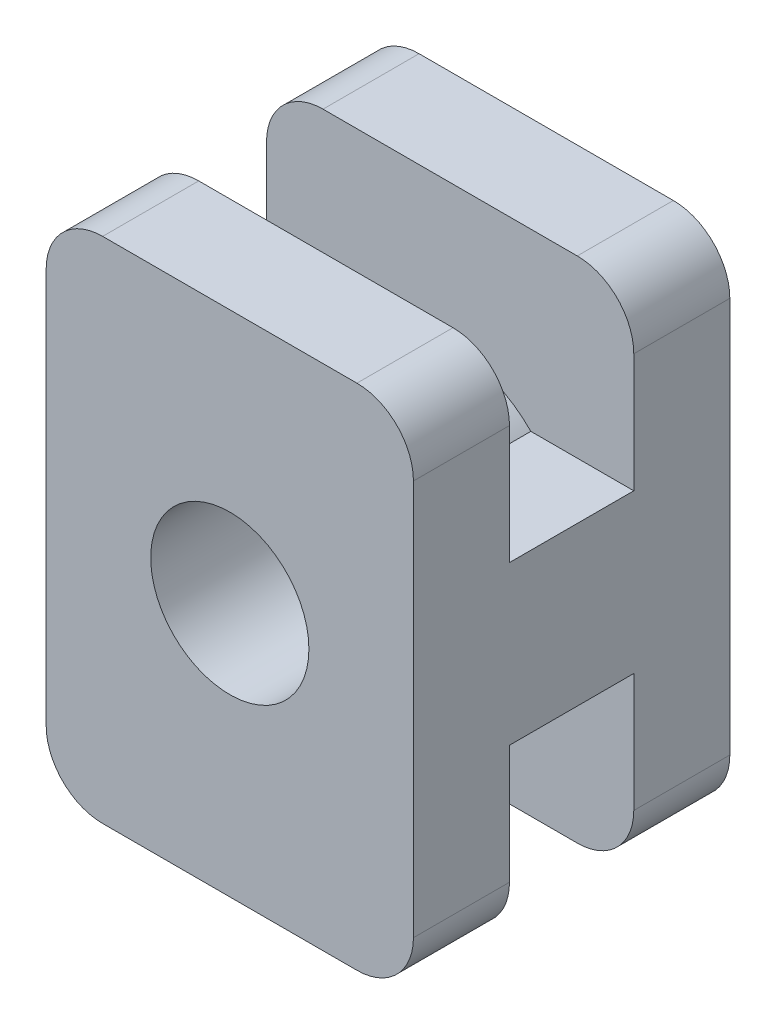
ISO-10303-21;
HEADER;
FILE_DESCRIPTION(('STEP AP214'),'2;1');
FILE_NAME('part.step','',(''),(''),'','','');
FILE_SCHEMA(('AUTOMOTIVE_DESIGN { 1 0 10303 214 1 1 1 1 }'));
ENDSEC;
DATA;
#1=APPLICATION_CONTEXT('core data for automotive mechanical design processes');
#2=APPLICATION_PROTOCOL_DEFINITION('international standard','automotive_design',2000,#1);
#3=PRODUCT_CONTEXT('',#1,'mechanical');
#4=PRODUCT('Part','Part','',(#3));
#5=PRODUCT_RELATED_PRODUCT_CATEGORY('part','',(#4));
#6=PRODUCT_DEFINITION_FORMATION('','',#4);
#7=PRODUCT_DEFINITION_CONTEXT('part definition',#1,'design');
#8=PRODUCT_DEFINITION('design','',#6,#7);
#9=PRODUCT_DEFINITION_SHAPE('','',#8);
#10=(LENGTH_UNIT() NAMED_UNIT(*) SI_UNIT(.MILLI.,.METRE.));
#11=(NAMED_UNIT(*) PLANE_ANGLE_UNIT() SI_UNIT($,.RADIAN.));
#12=(NAMED_UNIT(*) SI_UNIT($,.STERADIAN.) SOLID_ANGLE_UNIT());
#13=UNCERTAINTY_MEASURE_WITH_UNIT(LENGTH_MEASURE(1.E-05),#10,'distance_accuracy_value','');
#14=(GEOMETRIC_REPRESENTATION_CONTEXT(3) GLOBAL_UNCERTAINTY_ASSIGNED_CONTEXT((#13)) GLOBAL_UNIT_ASSIGNED_CONTEXT((#10,
#11,#12)) REPRESENTATION_CONTEXT('',''));
#15=CARTESIAN_POINT('',(0.,0.,0.));
#16=DIRECTION('',(0.,0.,1.));
#17=DIRECTION('',(1.,0.,0.));
#18=AXIS2_PLACEMENT_3D('',#15,#16,#17);
#19=CARTESIAN_POINT('',(-2.25,-3.5,2.8));
#20=DIRECTION('',(0.,0.,-1.));
#21=DIRECTION('',(-1.,0.,0.));
#22=AXIS2_PLACEMENT_3D('',#19,#20,#21);
#23=CYLINDRICAL_SURFACE('',#22,1.);
#24=CARTESIAN_POINT('',(-2.25,-3.5,1.1));
#25=DIRECTION('',(0.,0.,-1.));
#26=DIRECTION('',(-1.,0.,0.));
#27=AXIS2_PLACEMENT_3D('',#24,#25,#26);
#28=CIRCLE('',#27,1.);
#29=CARTESIAN_POINT('',(-2.25,-4.5,1.1));
#30=VERTEX_POINT('',#29);
#31=CARTESIAN_POINT('',(-3.25,-3.5,1.1));
#32=VERTEX_POINT('',#31);
#33=EDGE_CURVE('E20',#30,#32,#28,.T.);
#34=ORIENTED_EDGE('',*,*,#33,.F.);
#35=DIRECTION('',(0.,0.,1.));
#36=VECTOR('',#35,1.);
#37=CARTESIAN_POINT('',(-2.25,-4.5,2.8));
#38=LINE('',#37,#36);
#39=CARTESIAN_POINT('',(-2.25,-4.5,2.8));
#40=VERTEX_POINT('',#39);
#41=EDGE_CURVE('E144',#30,#40,#38,.T.);
#42=ORIENTED_EDGE('',*,*,#41,.T.);
#43=CARTESIAN_POINT('',(-2.25,-3.5,2.8));
#44=DIRECTION('',(0.,0.,-1.));
#45=DIRECTION('',(-1.,0.,0.));
#46=AXIS2_PLACEMENT_3D('',#43,#44,#45);
#47=CIRCLE('',#46,1.);
#48=CARTESIAN_POINT('',(-3.25,-3.5,2.8));
#49=VERTEX_POINT('',#48);
#50=EDGE_CURVE('E159',#40,#49,#47,.T.);
#51=ORIENTED_EDGE('',*,*,#50,.T.);
#52=DIRECTION('',(0.,0.,-1.));
#53=VECTOR('',#52,1.);
#54=CARTESIAN_POINT('',(-3.25,-3.5,2.8));
#55=LINE('',#54,#53);
#56=EDGE_CURVE('E158',#49,#32,#55,.T.);
#57=ORIENTED_EDGE('',*,*,#56,.T.);
#58=EDGE_LOOP('',(#34,#42,#51,#57));
#59=FACE_BOUND('',#58,.T.);
#60=ADVANCED_FACE('F17',(#59),#23,.T.);
#61=CARTESIAN_POINT('',(-3.25,-4.5,2.8));
#62=DIRECTION('',(1.,0.,0.));
#63=DIRECTION('',(0.,0.,-1.));
#64=AXIS2_PLACEMENT_3D('',#61,#62,#63);
#65=PLANE('',#64);
#66=DIRECTION('',(0.,0.,-1.));
#67=VECTOR('',#66,1.);
#68=CARTESIAN_POINT('',(-3.25,3.5,2.8));
#69=LINE('',#68,#67);
#70=CARTESIAN_POINT('',(-3.25,3.5,1.1));
#71=VERTEX_POINT('',#70);
#72=CARTESIAN_POINT('',(-3.25,3.5,2.8));
#73=VERTEX_POINT('',#72);
#74=EDGE_CURVE('E163',#71,#73,#69,.F.);
#75=ORIENTED_EDGE('',*,*,#74,.F.);
#76=DIRECTION('',(0.,1.,0.));
#77=VECTOR('',#76,1.);
#78=CARTESIAN_POINT('',(-3.25,0.,1.1));
#79=LINE('',#78,#77);
#80=EDGE_CURVE('E152',#32,#71,#79,.T.);
#81=ORIENTED_EDGE('',*,*,#80,.F.);
#82=ORIENTED_EDGE('',*,*,#56,.F.);
#83=DIRECTION('',(0.,1.,0.));
#84=VECTOR('',#83,1.);
#85=CARTESIAN_POINT('',(-3.25,0.,2.8));
#86=LINE('',#85,#84);
#87=EDGE_CURVE('E269',#49,#73,#86,.T.);
#88=ORIENTED_EDGE('',*,*,#87,.T.);
#89=EDGE_LOOP('',(#75,#81,#82,#88));
#90=FACE_BOUND('',#89,.T.);
#91=ADVANCED_FACE('F165',(#90),#65,.F.);
#92=CARTESIAN_POINT('',(-2.25,3.5,2.8));
#93=DIRECTION('',(0.,0.,-1.));
#94=DIRECTION('',(-1.,0.,0.));
#95=AXIS2_PLACEMENT_3D('',#92,#93,#94);
#96=CYLINDRICAL_SURFACE('',#95,1.);
#97=CARTESIAN_POINT('',(-2.25,3.5,1.1));
#98=DIRECTION('',(0.,0.,-1.));
#99=DIRECTION('',(-1.,0.,0.));
#100=AXIS2_PLACEMENT_3D('',#97,#98,#99);
#101=CIRCLE('',#100,1.);
#102=CARTESIAN_POINT('',(-2.25,4.5,1.1));
#103=VERTEX_POINT('',#102);
#104=EDGE_CURVE('E167',#71,#103,#101,.T.);
#105=ORIENTED_EDGE('',*,*,#104,.F.);
#106=ORIENTED_EDGE('',*,*,#74,.T.);
#107=CARTESIAN_POINT('',(-2.25,3.5,2.8));
#108=DIRECTION('',(0.,0.,-1.));
#109=DIRECTION('',(-1.,0.,0.));
#110=AXIS2_PLACEMENT_3D('',#107,#108,#109);
#111=CIRCLE('',#110,1.);
#112=CARTESIAN_POINT('',(-2.25,4.5,2.8));
#113=VERTEX_POINT('',#112);
#114=EDGE_CURVE('E266',#73,#113,#111,.T.);
#115=ORIENTED_EDGE('',*,*,#114,.T.);
#116=DIRECTION('',(0.,0.,-1.));
#117=VECTOR('',#116,1.);
#118=CARTESIAN_POINT('',(-2.25,4.5,2.8));
#119=LINE('',#118,#117);
#120=EDGE_CURVE('E214',#113,#103,#119,.T.);
#121=ORIENTED_EDGE('',*,*,#120,.T.);
#122=EDGE_LOOP('',(#105,#106,#115,#121));
#123=FACE_BOUND('',#122,.T.);
#124=ADVANCED_FACE('F352',(#123),#96,.T.);
#125=CARTESIAN_POINT('',(-3.25,4.5,2.8));
#126=DIRECTION('',(0.,-1.,0.));
#127=DIRECTION('',(0.,0.,-1.));
#128=AXIS2_PLACEMENT_3D('',#125,#126,#127);
#129=PLANE('',#128);
#130=ORIENTED_EDGE('',*,*,#120,.F.);
#131=DIRECTION('',(-1.,0.,0.));
#132=VECTOR('',#131,1.);
#133=CARTESIAN_POINT('',(0.,4.5,2.8));
#134=LINE('',#133,#132);
#135=CARTESIAN_POINT('',(2.25,4.5,2.8));
#136=VERTEX_POINT('',#135);
#137=EDGE_CURVE('E265',#113,#136,#134,.F.);
#138=ORIENTED_EDGE('',*,*,#137,.T.);
#139=DIRECTION('',(0.,0.,-1.));
#140=VECTOR('',#139,1.);
#141=CARTESIAN_POINT('',(2.25,4.5,2.8));
#142=LINE('',#141,#140);
#143=CARTESIAN_POINT('',(2.25,4.5,1.1));
#144=VERTEX_POINT('',#143);
#145=EDGE_CURVE('E210',#144,#136,#142,.F.);
#146=ORIENTED_EDGE('',*,*,#145,.F.);
#147=DIRECTION('',(-1.,0.,0.));
#148=VECTOR('',#147,1.);
#149=CARTESIAN_POINT('',(0.,4.5,1.1));
#150=LINE('',#149,#148);
#151=EDGE_CURVE('E169',#103,#144,#150,.F.);
#152=ORIENTED_EDGE('',*,*,#151,.F.);
#153=EDGE_LOOP('',(#130,#138,#146,#152));
#154=FACE_BOUND('',#153,.T.);
#155=ADVANCED_FACE('F284',(#154),#129,.F.);
#156=CARTESIAN_POINT('',(-3.25,-4.5,2.8));
#157=DIRECTION('',(0.,1.,0.));
#158=DIRECTION('',(0.,0.,1.));
#159=AXIS2_PLACEMENT_3D('',#156,#157,#158);
#160=PLANE('',#159);
#161=DIRECTION('',(0.,0.,-1.));
#162=VECTOR('',#161,1.);
#163=CARTESIAN_POINT('',(2.25,-4.5,1.1));
#164=LINE('',#163,#162);
#165=CARTESIAN_POINT('',(2.25,-4.5,2.8));
#166=VERTEX_POINT('',#165);
#167=CARTESIAN_POINT('',(2.25,-4.5,1.1));
#168=VERTEX_POINT('',#167);
#169=EDGE_CURVE('E215',#166,#168,#164,.T.);
#170=ORIENTED_EDGE('',*,*,#169,.F.);
#171=DIRECTION('',(-1.,0.,0.));
#172=VECTOR('',#171,1.);
#173=CARTESIAN_POINT('',(0.,-4.5,2.8));
#174=LINE('',#173,#172);
#175=EDGE_CURVE('E261',#166,#40,#174,.T.);
#176=ORIENTED_EDGE('',*,*,#175,.T.);
#177=ORIENTED_EDGE('',*,*,#41,.F.);
#178=DIRECTION('',(-1.,0.,0.));
#179=VECTOR('',#178,1.);
#180=CARTESIAN_POINT('',(0.,-4.5,1.1));
#181=LINE('',#180,#179);
#182=EDGE_CURVE('E155',#168,#30,#181,.T.);
#183=ORIENTED_EDGE('',*,*,#182,.F.);
#184=EDGE_LOOP('',(#170,#176,#177,#183));
#185=FACE_BOUND('',#184,.T.);
#186=ADVANCED_FACE('F341',(#185),#160,.F.);
#187=CARTESIAN_POINT('',(0.,0.,1.1));
#188=DIRECTION('',(0.,0.,-1.));
#189=DIRECTION('',(-1.,0.,0.));
#190=AXIS2_PLACEMENT_3D('',#187,#188,#189);
#191=CYLINDRICAL_SURFACE('',#190,2.);
#192=DIRECTION('',(0.,0.,-1.));
#193=VECTOR('',#192,1.);
#194=CARTESIAN_POINT('',(1.42828568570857,1.4,1.1));
#195=LINE('',#194,#193);
#196=CARTESIAN_POINT('',(1.42828568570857,1.4,1.1));
#197=VERTEX_POINT('',#196);
#198=CARTESIAN_POINT('',(1.42828568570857,1.4,-1.1));
#199=VERTEX_POINT('',#198);
#200=EDGE_CURVE('E207',#197,#199,#195,.T.);
#201=ORIENTED_EDGE('',*,*,#200,.T.);
#202=CARTESIAN_POINT('',(0.,0.,-1.1));
#203=DIRECTION('',(0.,0.,-1.));
#204=DIRECTION('',(-1.,0.,0.));
#205=AXIS2_PLACEMENT_3D('',#202,#203,#204);
#206=CIRCLE('',#205,2.);
#207=CARTESIAN_POINT('',(1.42828568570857,-1.4,-1.1));
#208=VERTEX_POINT('',#207);
#209=EDGE_CURVE('E255',#208,#199,#206,.T.);
#210=ORIENTED_EDGE('',*,*,#209,.F.);
#211=DIRECTION('',(0.,0.,1.));
#212=VECTOR('',#211,1.);
#213=CARTESIAN_POINT('',(1.42828568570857,-1.4,1.1));
#214=LINE('',#213,#212);
#215=CARTESIAN_POINT('',(1.42828568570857,-1.4,1.1));
#216=VERTEX_POINT('',#215);
#217=EDGE_CURVE('E174',#208,#216,#214,.T.);
#218=ORIENTED_EDGE('',*,*,#217,.T.);
#219=CARTESIAN_POINT('',(0.,0.,1.1));
#220=DIRECTION('',(0.,0.,-1.));
#221=DIRECTION('',(-1.,0.,0.));
#222=AXIS2_PLACEMENT_3D('',#219,#220,#221);
#223=CIRCLE('',#222,2.);
#224=EDGE_CURVE('E272',#197,#216,#223,.F.);
#225=ORIENTED_EDGE('',*,*,#224,.F.);
#226=EDGE_LOOP('',(#201,#210,#218,#225));
#227=FACE_BOUND('',#226,.T.);
#228=ADVANCED_FACE('F343',(#227),#191,.T.);
#229=CARTESIAN_POINT('',(2.25,3.5,2.8));
#230=DIRECTION('',(0.,0.,-1.));
#231=DIRECTION('',(-1.,0.,0.));
#232=AXIS2_PLACEMENT_3D('',#229,#230,#231);
#233=CYLINDRICAL_SURFACE('',#232,1.);
#234=CARTESIAN_POINT('',(2.25,3.5,1.1));
#235=DIRECTION('',(0.,0.,-1.));
#236=DIRECTION('',(-1.,0.,0.));
#237=AXIS2_PLACEMENT_3D('',#234,#235,#236);
#238=CIRCLE('',#237,1.);
#239=CARTESIAN_POINT('',(3.25,3.5,1.1));
#240=VERTEX_POINT('',#239);
#241=EDGE_CURVE('E275',#144,#240,#238,.T.);
#242=ORIENTED_EDGE('',*,*,#241,.F.);
#243=ORIENTED_EDGE('',*,*,#145,.T.);
#244=CARTESIAN_POINT('',(2.25,3.5,2.8));
#245=DIRECTION('',(0.,0.,-1.));
#246=DIRECTION('',(-1.,0.,0.));
#247=AXIS2_PLACEMENT_3D('',#244,#245,#246);
#248=CIRCLE('',#247,1.);
#249=CARTESIAN_POINT('',(3.25,3.5,2.8));
#250=VERTEX_POINT('',#249);
#251=EDGE_CURVE('E262',#136,#250,#248,.T.);
#252=ORIENTED_EDGE('',*,*,#251,.T.);
#253=DIRECTION('',(0.,0.,1.));
#254=VECTOR('',#253,1.);
#255=CARTESIAN_POINT('',(3.25,3.5,1.1));
#256=LINE('',#255,#254);
#257=EDGE_CURVE('E196',#250,#240,#256,.F.);
#258=ORIENTED_EDGE('',*,*,#257,.T.);
#259=EDGE_LOOP('',(#242,#243,#252,#258));
#260=FACE_BOUND('',#259,.T.);
#261=ADVANCED_FACE('F289',(#260),#233,.T.);
#262=CARTESIAN_POINT('',(1.42828568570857,1.4,1.1));
#263=DIRECTION('',(0.,-1.,0.));
#264=DIRECTION('',(0.,0.,-1.));
#265=AXIS2_PLACEMENT_3D('',#262,#263,#264);
#266=PLANE('',#265);
#267=ORIENTED_EDGE('',*,*,#200,.F.);
#268=DIRECTION('',(-1.,0.,0.));
#269=VECTOR('',#268,1.);
#270=CARTESIAN_POINT('',(0.,1.4,1.1));
#271=LINE('',#270,#269);
#272=CARTESIAN_POINT('',(3.25,1.4,1.1));
#273=VERTEX_POINT('',#272);
#274=EDGE_CURVE('E274',#273,#197,#271,.T.);
#275=ORIENTED_EDGE('',*,*,#274,.F.);
#276=DIRECTION('',(0.,0.,1.));
#277=VECTOR('',#276,1.);
#278=CARTESIAN_POINT('',(3.25,1.4,1.1));
#279=LINE('',#278,#277);
#280=CARTESIAN_POINT('',(3.25,1.4,-1.1));
#281=VERTEX_POINT('',#280);
#282=EDGE_CURVE('E187',#273,#281,#279,.F.);
#283=ORIENTED_EDGE('',*,*,#282,.T.);
#284=DIRECTION('',(1.,0.,0.));
#285=VECTOR('',#284,1.);
#286=CARTESIAN_POINT('',(0.,1.4,-1.1));
#287=LINE('',#286,#285);
#288=EDGE_CURVE('E254',#199,#281,#287,.T.);
#289=ORIENTED_EDGE('',*,*,#288,.F.);
#290=EDGE_LOOP('',(#267,#275,#283,#289));
#291=FACE_BOUND('',#290,.T.);
#292=ADVANCED_FACE('F407',(#291),#266,.F.);
#293=CARTESIAN_POINT('',(1.42828568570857,-1.4,1.1));
#294=DIRECTION('',(0.,1.,0.));
#295=DIRECTION('',(0.,0.,1.));
#296=AXIS2_PLACEMENT_3D('',#293,#294,#295);
#297=PLANE('',#296);
#298=DIRECTION('',(0.,0.,1.));
#299=VECTOR('',#298,1.);
#300=CARTESIAN_POINT('',(3.25,-1.4,1.1));
#301=LINE('',#300,#299);
#302=CARTESIAN_POINT('',(3.25,-1.4,-1.1));
#303=VERTEX_POINT('',#302);
#304=CARTESIAN_POINT('',(3.25,-1.4,1.1));
#305=VERTEX_POINT('',#304);
#306=EDGE_CURVE('E175',#303,#305,#301,.T.);
#307=ORIENTED_EDGE('',*,*,#306,.T.);
#308=DIRECTION('',(-1.,0.,0.));
#309=VECTOR('',#308,1.);
#310=CARTESIAN_POINT('',(0.,-1.4,1.1));
#311=LINE('',#310,#309);
#312=EDGE_CURVE('E218',#216,#305,#311,.F.);
#313=ORIENTED_EDGE('',*,*,#312,.F.);
#314=ORIENTED_EDGE('',*,*,#217,.F.);
#315=DIRECTION('',(1.,0.,0.));
#316=VECTOR('',#315,1.);
#317=CARTESIAN_POINT('',(0.,-1.4,-1.1));
#318=LINE('',#317,#316);
#319=EDGE_CURVE('E257',#303,#208,#318,.F.);
#320=ORIENTED_EDGE('',*,*,#319,.F.);
#321=EDGE_LOOP('',(#307,#313,#314,#320));
#322=FACE_BOUND('',#321,.T.);
#323=ADVANCED_FACE('F318',(#322),#297,.F.);
#324=CARTESIAN_POINT('',(0.,0.,1.1));
#325=DIRECTION('',(0.,0.,-1.));
#326=DIRECTION('',(-1.,0.,0.));
#327=AXIS2_PLACEMENT_3D('',#324,#325,#326);
#328=PLANE('',#327);
#329=ORIENTED_EDGE('',*,*,#224,.T.);
#330=ORIENTED_EDGE('',*,*,#312,.T.);
#331=DIRECTION('',(0.,1.,0.));
#332=VECTOR('',#331,1.);
#333=CARTESIAN_POINT('',(3.25,1.4,1.1));
#334=LINE('',#333,#332);
#335=CARTESIAN_POINT('',(3.25,-3.5,1.1));
#336=VERTEX_POINT('',#335);
#337=EDGE_CURVE('E178',#305,#336,#334,.F.);
#338=ORIENTED_EDGE('',*,*,#337,.T.);
#339=CARTESIAN_POINT('',(2.25,-3.5,1.1));
#340=DIRECTION('',(0.,0.,-1.));
#341=DIRECTION('',(-1.,0.,0.));
#342=AXIS2_PLACEMENT_3D('',#339,#340,#341);
#343=CIRCLE('',#342,1.);
#344=EDGE_CURVE('E217',#168,#336,#343,.F.);
#345=ORIENTED_EDGE('',*,*,#344,.F.);
#346=ORIENTED_EDGE('',*,*,#182,.T.);
#347=ORIENTED_EDGE('',*,*,#33,.T.);
#348=ORIENTED_EDGE('',*,*,#80,.T.);
#349=ORIENTED_EDGE('',*,*,#104,.T.);
#350=ORIENTED_EDGE('',*,*,#151,.T.);
#351=ORIENTED_EDGE('',*,*,#241,.T.);
#352=DIRECTION('',(0.,1.,0.));
#353=VECTOR('',#352,1.);
#354=CARTESIAN_POINT('',(3.25,1.4,1.1));
#355=LINE('',#354,#353);
#356=EDGE_CURVE('E191',#240,#273,#355,.F.);
#357=ORIENTED_EDGE('',*,*,#356,.T.);
#358=ORIENTED_EDGE('',*,*,#274,.T.);
#359=EDGE_LOOP('',(#329,#330,#338,#345,#346,#347,#348,#349,#350,#351,#357,#358));
#360=FACE_BOUND('',#359,.T.);
#361=ADVANCED_FACE('F150',(#360),#328,.T.);
#362=CARTESIAN_POINT('',(2.25,-3.5,1.1));
#363=DIRECTION('',(0.,0.,-1.));
#364=DIRECTION('',(-1.,0.,0.));
#365=AXIS2_PLACEMENT_3D('',#362,#363,#364);
#366=CYLINDRICAL_SURFACE('',#365,1.);
#367=ORIENTED_EDGE('',*,*,#344,.T.);
#368=DIRECTION('',(0.,0.,1.));
#369=VECTOR('',#368,1.);
#370=CARTESIAN_POINT('',(3.25,-3.5,1.1));
#371=LINE('',#370,#369);
#372=CARTESIAN_POINT('',(3.25,-3.5,2.8));
#373=VERTEX_POINT('',#372);
#374=EDGE_CURVE('E300',#336,#373,#371,.T.);
#375=ORIENTED_EDGE('',*,*,#374,.T.);
#376=CARTESIAN_POINT('',(2.25,-3.5,2.8));
#377=DIRECTION('',(0.,0.,-1.));
#378=DIRECTION('',(-1.,0.,0.));
#379=AXIS2_PLACEMENT_3D('',#376,#377,#378);
#380=CIRCLE('',#379,1.);
#381=EDGE_CURVE('E258',#373,#166,#380,.T.);
#382=ORIENTED_EDGE('',*,*,#381,.T.);
#383=ORIENTED_EDGE('',*,*,#169,.T.);
#384=EDGE_LOOP('',(#367,#375,#382,#383));
#385=FACE_BOUND('',#384,.T.);
#386=ADVANCED_FACE('F340',(#385),#366,.T.);
#387=CARTESIAN_POINT('',(0.,0.,2.8));
#388=DIRECTION('',(0.,0.,-1.));
#389=DIRECTION('',(-1.,0.,0.));
#390=AXIS2_PLACEMENT_3D('',#387,#388,#389);
#391=PLANE('',#390);
#392=ORIENTED_EDGE('',*,*,#381,.F.);
#393=DIRECTION('',(0.,1.,0.));
#394=VECTOR('',#393,1.);
#395=CARTESIAN_POINT('',(3.25,1.4,2.8));
#396=LINE('',#395,#394);
#397=EDGE_CURVE('E244',#373,#250,#396,.T.);
#398=ORIENTED_EDGE('',*,*,#397,.T.);
#399=ORIENTED_EDGE('',*,*,#251,.F.);
#400=ORIENTED_EDGE('',*,*,#137,.F.);
#401=ORIENTED_EDGE('',*,*,#114,.F.);
#402=ORIENTED_EDGE('',*,*,#87,.F.);
#403=ORIENTED_EDGE('',*,*,#50,.F.);
#404=ORIENTED_EDGE('',*,*,#175,.F.);
#405=EDGE_LOOP('',(#392,#398,#399,#400,#401,#402,#403,#404));
#406=FACE_BOUND('',#405,.T.);
#407=CARTESIAN_POINT('',(0.,0.,2.8));
#408=DIRECTION('',(0.,0.,1.));
#409=DIRECTION('',(1.,0.,0.));
#410=AXIS2_PLACEMENT_3D('',#407,#408,#409);
#411=CIRCLE('',#410,1.4);
#412=CARTESIAN_POINT('',(1.4,0.,2.8));
#413=VERTEX_POINT('',#412);
#414=EDGE_CURVE('E251',#413,#413,#411,.F.);
#415=ORIENTED_EDGE('',*,*,#414,.T.);
#416=EDGE_LOOP('',(#415));
#417=FACE_BOUND('',#416,.T.);
#418=ADVANCED_FACE('F337',(#406,#417),#391,.F.);
#419=CARTESIAN_POINT('',(0.,0.,-1.1));
#420=DIRECTION('',(0.,0.,1.));
#421=DIRECTION('',(1.,0.,0.));
#422=AXIS2_PLACEMENT_3D('',#419,#420,#421);
#423=PLANE('',#422);
#424=ORIENTED_EDGE('',*,*,#209,.T.);
#425=ORIENTED_EDGE('',*,*,#288,.T.);
#426=DIRECTION('',(0.,1.,0.));
#427=VECTOR('',#426,1.);
#428=CARTESIAN_POINT('',(3.25,1.4,-1.1));
#429=LINE('',#428,#427);
#430=CARTESIAN_POINT('',(3.25,3.5,-1.1));
#431=VERTEX_POINT('',#430);
#432=EDGE_CURVE('E190',#281,#431,#429,.T.);
#433=ORIENTED_EDGE('',*,*,#432,.T.);
#434=CARTESIAN_POINT('',(2.25,3.5,-1.1));
#435=DIRECTION('',(0.,0.,-1.));
#436=DIRECTION('',(-1.,0.,0.));
#437=AXIS2_PLACEMENT_3D('',#434,#435,#436);
#438=CIRCLE('',#437,1.);
#439=CARTESIAN_POINT('',(2.25,4.5,-1.1));
#440=VERTEX_POINT('',#439);
#441=EDGE_CURVE('E241',#440,#431,#438,.T.);
#442=ORIENTED_EDGE('',*,*,#441,.F.);
#443=DIRECTION('',(1.,0.,0.));
#444=VECTOR('',#443,1.);
#445=CARTESIAN_POINT('',(-3.25,4.5,-1.1));
#446=LINE('',#445,#444);
#447=CARTESIAN_POINT('',(-2.25,4.5,-1.1));
#448=VERTEX_POINT('',#447);
#449=EDGE_CURVE('E574',#448,#440,#446,.T.);
#450=ORIENTED_EDGE('',*,*,#449,.F.);
#451=CARTESIAN_POINT('',(-2.25,3.5,-1.1));
#452=DIRECTION('',(0.,0.,1.));
#453=DIRECTION('',(1.,0.,0.));
#454=AXIS2_PLACEMENT_3D('',#451,#452,#453);
#455=CIRCLE('',#454,1.);
#456=CARTESIAN_POINT('',(-3.25,3.5,-1.1));
#457=VERTEX_POINT('',#456);
#458=EDGE_CURVE('E206',#457,#448,#455,.F.);
#459=ORIENTED_EDGE('',*,*,#458,.F.);
#460=DIRECTION('',(0.,1.,0.));
#461=VECTOR('',#460,1.);
#462=CARTESIAN_POINT('',(-3.25,-4.5,-1.1));
#463=LINE('',#462,#461);
#464=CARTESIAN_POINT('',(-3.25,-3.5,-1.1));
#465=VERTEX_POINT('',#464);
#466=EDGE_CURVE('E203',#465,#457,#463,.T.);
#467=ORIENTED_EDGE('',*,*,#466,.F.);
#468=CARTESIAN_POINT('',(-2.25,-3.5,-1.1));
#469=DIRECTION('',(0.,0.,1.));
#470=DIRECTION('',(1.,0.,0.));
#471=AXIS2_PLACEMENT_3D('',#468,#469,#470);
#472=CIRCLE('',#471,1.);
#473=CARTESIAN_POINT('',(-2.25,-4.5,-1.1));
#474=VERTEX_POINT('',#473);
#475=EDGE_CURVE('E248',#474,#465,#472,.F.);
#476=ORIENTED_EDGE('',*,*,#475,.F.);
#477=DIRECTION('',(1.,0.,0.));
#478=VECTOR('',#477,1.);
#479=CARTESIAN_POINT('',(-3.25,-4.5,-1.1));
#480=LINE('',#479,#478);
#481=CARTESIAN_POINT('',(2.25,-4.5,-1.1));
#482=VERTEX_POINT('',#481);
#483=EDGE_CURVE('E199',#482,#474,#480,.F.);
#484=ORIENTED_EDGE('',*,*,#483,.F.);
#485=CARTESIAN_POINT('',(2.25,-3.5,-1.1));
#486=DIRECTION('',(0.,0.,-1.));
#487=DIRECTION('',(-1.,0.,0.));
#488=AXIS2_PLACEMENT_3D('',#485,#486,#487);
#489=CIRCLE('',#488,1.);
#490=CARTESIAN_POINT('',(3.25,-3.5,-1.1));
#491=VERTEX_POINT('',#490);
#492=EDGE_CURVE('E245',#491,#482,#489,.T.);
#493=ORIENTED_EDGE('',*,*,#492,.F.);
#494=DIRECTION('',(0.,1.,0.));
#495=VECTOR('',#494,1.);
#496=CARTESIAN_POINT('',(3.25,1.4,-1.1));
#497=LINE('',#496,#495);
#498=EDGE_CURVE('E179',#491,#303,#497,.T.);
#499=ORIENTED_EDGE('',*,*,#498,.T.);
#500=ORIENTED_EDGE('',*,*,#319,.T.);
#501=EDGE_LOOP('',(#424,#425,#433,#442,#450,#459,#467,#476,#484,#493,#499,#500));
#502=FACE_BOUND('',#501,.T.);
#503=ADVANCED_FACE('F395',(#502),#423,.T.);
#504=CARTESIAN_POINT('',(0.,0.,-2.8));
#505=DIRECTION('',(0.,0.,1.));
#506=DIRECTION('',(1.,0.,0.));
#507=AXIS2_PLACEMENT_3D('',#504,#505,#506);
#508=CYLINDRICAL_SURFACE('',#507,1.4);
#509=CARTESIAN_POINT('',(0.,0.,-2.8));
#510=DIRECTION('',(0.,0.,1.));
#511=DIRECTION('',(1.,0.,0.));
#512=AXIS2_PLACEMENT_3D('',#509,#510,#511);
#513=CIRCLE('',#512,1.4);
#514=CARTESIAN_POINT('',(1.4,0.,-2.8));
#515=VERTEX_POINT('',#514);
#516=EDGE_CURVE('E237',#515,#515,#513,.F.);
#517=ORIENTED_EDGE('',*,*,#516,.T.);
#518=EDGE_LOOP('',(#517));
#519=FACE_BOUND('',#518,.T.);
#520=ORIENTED_EDGE('',*,*,#414,.F.);
#521=EDGE_LOOP('',(#520));
#522=FACE_BOUND('',#521,.T.);
#523=ADVANCED_FACE('F391',(#519,#522),#508,.F.);
#524=CARTESIAN_POINT('',(-2.25,3.5,-2.8));
#525=DIRECTION('',(0.,0.,1.));
#526=DIRECTION('',(1.,0.,0.));
#527=AXIS2_PLACEMENT_3D('',#524,#525,#526);
#528=CYLINDRICAL_SURFACE('',#527,1.);
#529=ORIENTED_EDGE('',*,*,#458,.T.);
#530=DIRECTION('',(0.,0.,1.));
#531=VECTOR('',#530,1.);
#532=CARTESIAN_POINT('',(-2.25,4.5,-2.8));
#533=LINE('',#532,#531);
#534=CARTESIAN_POINT('',(-2.25,4.5,-2.8));
#535=VERTEX_POINT('',#534);
#536=EDGE_CURVE('E240',#535,#448,#533,.T.);
#537=ORIENTED_EDGE('',*,*,#536,.F.);
#538=CARTESIAN_POINT('',(-2.25,3.5,-2.8));
#539=DIRECTION('',(0.,0.,1.));
#540=DIRECTION('',(1.,0.,0.));
#541=AXIS2_PLACEMENT_3D('',#538,#539,#540);
#542=CIRCLE('',#541,1.);
#543=CARTESIAN_POINT('',(-3.25,3.5,-2.8));
#544=VERTEX_POINT('',#543);
#545=EDGE_CURVE('E234',#535,#544,#542,.T.);
#546=ORIENTED_EDGE('',*,*,#545,.T.);
#547=DIRECTION('',(0.,0.,1.));
#548=VECTOR('',#547,1.);
#549=CARTESIAN_POINT('',(-3.25,3.5,-2.8));
#550=LINE('',#549,#548);
#551=EDGE_CURVE('E205',#457,#544,#550,.F.);
#552=ORIENTED_EDGE('',*,*,#551,.F.);
#553=EDGE_LOOP('',(#529,#537,#546,#552));
#554=FACE_BOUND('',#553,.T.);
#555=ADVANCED_FACE('F387',(#554),#528,.T.);
#556=CARTESIAN_POINT('',(-3.25,-4.5,-2.8));
#557=DIRECTION('',(-1.,0.,0.));
#558=DIRECTION('',(0.,0.,1.));
#559=AXIS2_PLACEMENT_3D('',#556,#557,#558);
#560=PLANE('',#559);
#561=DIRECTION('',(0.,1.,0.));
#562=VECTOR('',#561,1.);
#563=CARTESIAN_POINT('',(-3.25,0.,-2.8));
#564=LINE('',#563,#562);
#565=CARTESIAN_POINT('',(-3.25,-3.5,-2.8));
#566=VERTEX_POINT('',#565);
#567=EDGE_CURVE('E233',#544,#566,#564,.F.);
#568=ORIENTED_EDGE('',*,*,#567,.T.);
#569=DIRECTION('',(0.,0.,1.));
#570=VECTOR('',#569,1.);
#571=CARTESIAN_POINT('',(-3.25,-3.5,-2.8));
#572=LINE('',#571,#570);
#573=EDGE_CURVE('E202',#465,#566,#572,.F.);
#574=ORIENTED_EDGE('',*,*,#573,.F.);
#575=ORIENTED_EDGE('',*,*,#466,.T.);
#576=ORIENTED_EDGE('',*,*,#551,.T.);
#577=EDGE_LOOP('',(#568,#574,#575,#576));
#578=FACE_BOUND('',#577,.T.);
#579=ADVANCED_FACE('F383',(#578),#560,.T.);
#580=CARTESIAN_POINT('',(-2.25,-3.5,-2.8));
#581=DIRECTION('',(0.,0.,1.));
#582=DIRECTION('',(1.,0.,0.));
#583=AXIS2_PLACEMENT_3D('',#580,#581,#582);
#584=CYLINDRICAL_SURFACE('',#583,1.);
#585=ORIENTED_EDGE('',*,*,#475,.T.);
#586=ORIENTED_EDGE('',*,*,#573,.T.);
#587=CARTESIAN_POINT('',(-2.25,-3.5,-2.8));
#588=DIRECTION('',(0.,0.,1.));
#589=DIRECTION('',(1.,0.,0.));
#590=AXIS2_PLACEMENT_3D('',#587,#588,#589);
#591=CIRCLE('',#590,1.);
#592=CARTESIAN_POINT('',(-2.25,-4.5,-2.8));
#593=VERTEX_POINT('',#592);
#594=EDGE_CURVE('E230',#566,#593,#591,.T.);
#595=ORIENTED_EDGE('',*,*,#594,.T.);
#596=DIRECTION('',(0.,0.,-1.));
#597=VECTOR('',#596,1.);
#598=CARTESIAN_POINT('',(-2.25,-4.5,-2.8));
#599=LINE('',#598,#597);
#600=EDGE_CURVE('E201',#474,#593,#599,.T.);
#601=ORIENTED_EDGE('',*,*,#600,.F.);
#602=EDGE_LOOP('',(#585,#586,#595,#601));
#603=FACE_BOUND('',#602,.T.);
#604=ADVANCED_FACE('F379',(#603),#584,.T.);
#605=CARTESIAN_POINT('',(-3.25,-4.5,-2.8));
#606=DIRECTION('',(0.,-1.,0.));
#607=DIRECTION('',(0.,0.,-1.));
#608=AXIS2_PLACEMENT_3D('',#605,#606,#607);
#609=PLANE('',#608);
#610=ORIENTED_EDGE('',*,*,#483,.T.);
#611=ORIENTED_EDGE('',*,*,#600,.T.);
#612=DIRECTION('',(1.,0.,0.));
#613=VECTOR('',#612,1.);
#614=CARTESIAN_POINT('',(0.,-4.5,-2.8));
#615=LINE('',#614,#613);
#616=CARTESIAN_POINT('',(2.25,-4.5,-2.8));
#617=VERTEX_POINT('',#616);
#618=EDGE_CURVE('E229',#593,#617,#615,.T.);
#619=ORIENTED_EDGE('',*,*,#618,.T.);
#620=DIRECTION('',(0.,0.,-1.));
#621=VECTOR('',#620,1.);
#622=CARTESIAN_POINT('',(2.25,-4.5,-2.8));
#623=LINE('',#622,#621);
#624=EDGE_CURVE('E247',#482,#617,#623,.T.);
#625=ORIENTED_EDGE('',*,*,#624,.F.);
#626=EDGE_LOOP('',(#610,#611,#619,#625));
#627=FACE_BOUND('',#626,.T.);
#628=ADVANCED_FACE('F375',(#627),#609,.T.);
#629=CARTESIAN_POINT('',(2.25,-3.5,-2.8));
#630=DIRECTION('',(0.,0.,-1.));
#631=DIRECTION('',(-1.,0.,0.));
#632=AXIS2_PLACEMENT_3D('',#629,#630,#631);
#633=CYLINDRICAL_SURFACE('',#632,1.);
#634=ORIENTED_EDGE('',*,*,#492,.T.);
#635=ORIENTED_EDGE('',*,*,#624,.T.);
#636=CARTESIAN_POINT('',(2.25,-3.5,-2.8));
#637=DIRECTION('',(0.,0.,-1.));
#638=DIRECTION('',(-1.,0.,0.));
#639=AXIS2_PLACEMENT_3D('',#636,#637,#638);
#640=CIRCLE('',#639,1.);
#641=CARTESIAN_POINT('',(3.25,-3.5,-2.8));
#642=VERTEX_POINT('',#641);
#643=EDGE_CURVE('E226',#617,#642,#640,.F.);
#644=ORIENTED_EDGE('',*,*,#643,.T.);
#645=DIRECTION('',(0.,0.,1.));
#646=VECTOR('',#645,1.);
#647=CARTESIAN_POINT('',(3.25,-3.5,1.1));
#648=LINE('',#647,#646);
#649=EDGE_CURVE('E184',#642,#491,#648,.T.);
#650=ORIENTED_EDGE('',*,*,#649,.T.);
#651=EDGE_LOOP('',(#634,#635,#644,#650));
#652=FACE_BOUND('',#651,.T.);
#653=ADVANCED_FACE('F372',(#652),#633,.T.);
#654=CARTESIAN_POINT('',(3.25,1.4,1.1));
#655=DIRECTION('',(-1.,0.,0.));
#656=DIRECTION('',(0.,0.,1.));
#657=AXIS2_PLACEMENT_3D('',#654,#655,#656);
#658=PLANE('',#657);
#659=ORIENTED_EDGE('',*,*,#374,.F.);
#660=ORIENTED_EDGE('',*,*,#337,.F.);
#661=ORIENTED_EDGE('',*,*,#306,.F.);
#662=ORIENTED_EDGE('',*,*,#498,.F.);
#663=ORIENTED_EDGE('',*,*,#649,.F.);
#664=DIRECTION('',(0.,1.,0.));
#665=VECTOR('',#664,1.);
#666=CARTESIAN_POINT('',(3.25,0.,-2.8));
#667=LINE('',#666,#665);
#668=CARTESIAN_POINT('',(3.25,3.5,-2.8));
#669=VERTEX_POINT('',#668);
#670=EDGE_CURVE('E225',#642,#669,#667,.T.);
#671=ORIENTED_EDGE('',*,*,#670,.T.);
#672=DIRECTION('',(0.,0.,-1.));
#673=VECTOR('',#672,1.);
#674=CARTESIAN_POINT('',(3.25,3.5,1.1));
#675=LINE('',#674,#673);
#676=EDGE_CURVE('E243',#431,#669,#675,.T.);
#677=ORIENTED_EDGE('',*,*,#676,.F.);
#678=ORIENTED_EDGE('',*,*,#432,.F.);
#679=ORIENTED_EDGE('',*,*,#282,.F.);
#680=ORIENTED_EDGE('',*,*,#356,.F.);
#681=ORIENTED_EDGE('',*,*,#257,.F.);
#682=ORIENTED_EDGE('',*,*,#397,.F.);
#683=EDGE_LOOP('',(#659,#660,#661,#662,#663,#671,#677,#678,#679,#680,#681,#682));
#684=FACE_BOUND('',#683,.T.);
#685=ADVANCED_FACE('F314',(#684),#658,.F.);
#686=CARTESIAN_POINT('',(2.25,3.5,1.1));
#687=DIRECTION('',(0.,0.,-1.));
#688=DIRECTION('',(-1.,0.,0.));
#689=AXIS2_PLACEMENT_3D('',#686,#687,#688);
#690=CYLINDRICAL_SURFACE('',#689,1.);
#691=ORIENTED_EDGE('',*,*,#441,.T.);
#692=ORIENTED_EDGE('',*,*,#676,.T.);
#693=CARTESIAN_POINT('',(2.25,3.5,-2.8));
#694=DIRECTION('',(0.,0.,-1.));
#695=DIRECTION('',(-1.,0.,0.));
#696=AXIS2_PLACEMENT_3D('',#693,#694,#695);
#697=CIRCLE('',#696,1.);
#698=CARTESIAN_POINT('',(2.25,4.5,-2.8));
#699=VERTEX_POINT('',#698);
#700=EDGE_CURVE('E26',#669,#699,#697,.F.);
#701=ORIENTED_EDGE('',*,*,#700,.T.);
#702=DIRECTION('',(0.,0.,1.));
#703=VECTOR('',#702,1.);
#704=CARTESIAN_POINT('',(2.25,4.5,-2.8));
#705=LINE('',#704,#703);
#706=EDGE_CURVE('E34',#440,#699,#705,.F.);
#707=ORIENTED_EDGE('',*,*,#706,.F.);
#708=EDGE_LOOP('',(#691,#692,#701,#707));
#709=FACE_BOUND('',#708,.T.);
#710=ADVANCED_FACE('F362',(#709),#690,.T.);
#711=CARTESIAN_POINT('',(-3.25,4.5,-2.8));
#712=DIRECTION('',(0.,1.,0.));
#713=DIRECTION('',(0.,0.,1.));
#714=AXIS2_PLACEMENT_3D('',#711,#712,#713);
#715=PLANE('',#714);
#716=DIRECTION('',(1.,0.,0.));
#717=VECTOR('',#716,1.);
#718=CARTESIAN_POINT('',(0.,4.5,-2.8));
#719=LINE('',#718,#717);
#720=EDGE_CURVE('E11',#699,#535,#719,.F.);
#721=ORIENTED_EDGE('',*,*,#720,.T.);
#722=ORIENTED_EDGE('',*,*,#536,.T.);
#723=ORIENTED_EDGE('',*,*,#449,.T.);
#724=ORIENTED_EDGE('',*,*,#706,.T.);
#725=EDGE_LOOP('',(#721,#722,#723,#724));
#726=FACE_BOUND('',#725,.T.);
#727=ADVANCED_FACE('F356',(#726),#715,.T.);
#728=CARTESIAN_POINT('',(0.,0.,-2.8));
#729=DIRECTION('',(0.,0.,1.));
#730=DIRECTION('',(1.,0.,0.));
#731=AXIS2_PLACEMENT_3D('',#728,#729,#730);
#732=PLANE('',#731);
#733=ORIENTED_EDGE('',*,*,#700,.F.);
#734=ORIENTED_EDGE('',*,*,#670,.F.);
#735=ORIENTED_EDGE('',*,*,#643,.F.);
#736=ORIENTED_EDGE('',*,*,#618,.F.);
#737=ORIENTED_EDGE('',*,*,#594,.F.);
#738=ORIENTED_EDGE('',*,*,#567,.F.);
#739=ORIENTED_EDGE('',*,*,#545,.F.);
#740=ORIENTED_EDGE('',*,*,#720,.F.);
#741=EDGE_LOOP('',(#733,#734,#735,#736,#737,#738,#739,#740));
#742=FACE_BOUND('',#741,.T.);
#743=ORIENTED_EDGE('',*,*,#516,.F.);
#744=EDGE_LOOP('',(#743));
#745=FACE_BOUND('',#744,.T.);
#746=ADVANCED_FACE('F354',(#742,#745),#732,.F.);
#747=CLOSED_SHELL('',(#60,#91,#124,#155,#186,#228,#261,#292,#323,#361,#386,#418,#503,#523,#555,
#579,#604,#628,#653,#685,#710,#727,#746));
#748=MANIFOLD_SOLID_BREP('B1',#747);
#749=ADVANCED_BREP_SHAPE_REPRESENTATION('',(#18,#748),#14);
#750=SHAPE_DEFINITION_REPRESENTATION(#9,#749);
ENDSEC;
END-ISO-10303-21;
